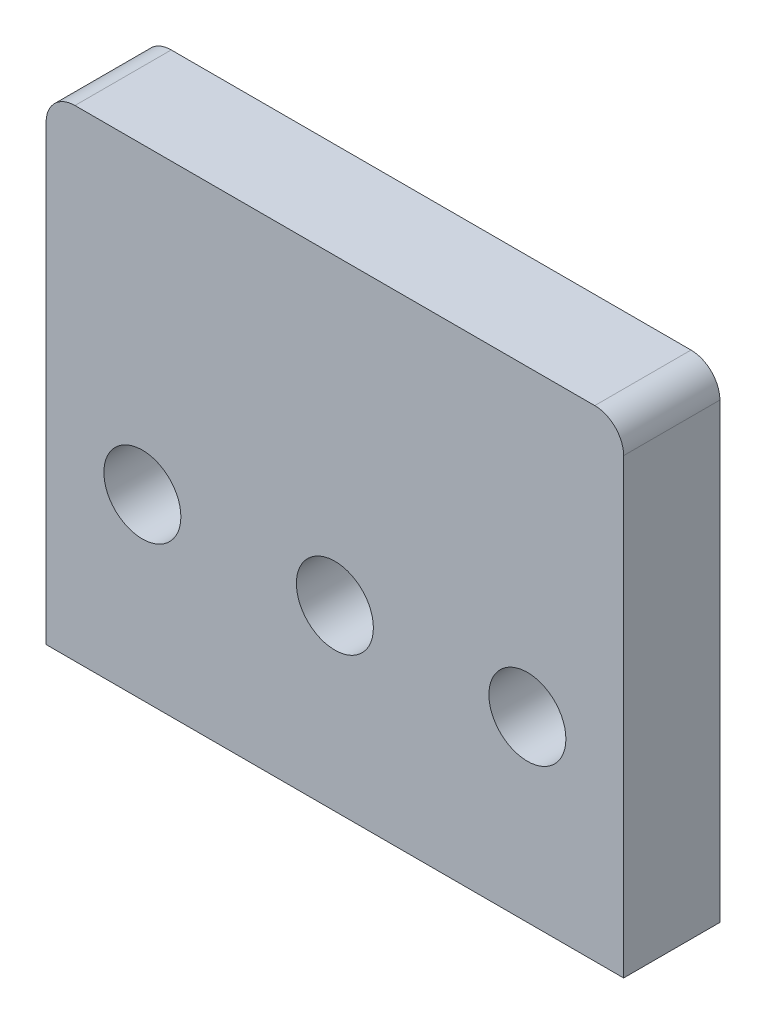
ISO-10303-21;
HEADER;
FILE_DESCRIPTION(('STEP AP214'),'2;1');
FILE_NAME('part.step','',(''),(''),'','','');
FILE_SCHEMA(('AUTOMOTIVE_DESIGN { 1 0 10303 214 1 1 1 1 }'));
ENDSEC;
DATA;
#1=APPLICATION_CONTEXT('core data for automotive mechanical design processes');
#2=APPLICATION_PROTOCOL_DEFINITION('international standard','automotive_design',2000,#1);
#3=PRODUCT_CONTEXT('',#1,'mechanical');
#4=PRODUCT('Part','Part','',(#3));
#5=PRODUCT_RELATED_PRODUCT_CATEGORY('part','',(#4));
#6=PRODUCT_DEFINITION_FORMATION('','',#4);
#7=PRODUCT_DEFINITION_CONTEXT('part definition',#1,'design');
#8=PRODUCT_DEFINITION('design','',#6,#7);
#9=PRODUCT_DEFINITION_SHAPE('','',#8);
#10=(LENGTH_UNIT() NAMED_UNIT(*) SI_UNIT(.MILLI.,.METRE.));
#11=(NAMED_UNIT(*) PLANE_ANGLE_UNIT() SI_UNIT($,.RADIAN.));
#12=(NAMED_UNIT(*) SI_UNIT($,.STERADIAN.) SOLID_ANGLE_UNIT());
#13=UNCERTAINTY_MEASURE_WITH_UNIT(LENGTH_MEASURE(1.E-05),#10,'distance_accuracy_value','');
#14=(GEOMETRIC_REPRESENTATION_CONTEXT(3) GLOBAL_UNCERTAINTY_ASSIGNED_CONTEXT((#13)) GLOBAL_UNIT_ASSIGNED_CONTEXT((#10,
#11,#12)) REPRESENTATION_CONTEXT('',''));
#15=CARTESIAN_POINT('',(0.,0.,0.));
#16=DIRECTION('',(0.,0.,1.));
#17=DIRECTION('',(1.,0.,0.));
#18=AXIS2_PLACEMENT_3D('',#15,#16,#17);
#19=CARTESIAN_POINT('',(-30.,-18.5,10.));
#20=DIRECTION('',(-1.,0.,0.));
#21=DIRECTION('',(0.,0.,1.));
#22=AXIS2_PLACEMENT_3D('',#19,#20,#21);
#23=PLANE('',#22);
#24=DIRECTION('',(0.,1.,0.));
#25=VECTOR('',#24,1.);
#26=CARTESIAN_POINT('',(-30.,-18.5,10.));
#27=LINE('',#26,#25);
#28=CARTESIAN_POINT('',(-30.,-18.5,10.));
#29=VERTEX_POINT('',#28);
#30=CARTESIAN_POINT('',(-30.,28.5,10.));
#31=VERTEX_POINT('',#30);
#32=EDGE_CURVE('E103',#29,#31,#27,.T.);
#33=ORIENTED_EDGE('',*,*,#32,.T.);
#34=DIRECTION('',(0.,0.,-1.));
#35=VECTOR('',#34,1.);
#36=CARTESIAN_POINT('',(-30.,28.5,10.));
#37=LINE('',#36,#35);
#38=CARTESIAN_POINT('',(-30.,28.5,0.));
#39=VERTEX_POINT('',#38);
#40=EDGE_CURVE('E114',#31,#39,#37,.T.);
#41=ORIENTED_EDGE('',*,*,#40,.T.);
#42=DIRECTION('',(0.,1.,0.));
#43=VECTOR('',#42,1.);
#44=CARTESIAN_POINT('',(-30.,-18.5,0.));
#45=LINE('',#44,#43);
#46=CARTESIAN_POINT('',(-30.,-18.5,0.));
#47=VERTEX_POINT('',#46);
#48=EDGE_CURVE('E133',#47,#39,#45,.T.);
#49=ORIENTED_EDGE('',*,*,#48,.F.);
#50=DIRECTION('',(0.,0.,-1.));
#51=VECTOR('',#50,1.);
#52=CARTESIAN_POINT('',(-30.,-18.5,10.));
#53=LINE('',#52,#51);
#54=EDGE_CURVE('E99',#29,#47,#53,.T.);
#55=ORIENTED_EDGE('',*,*,#54,.F.);
#56=EDGE_LOOP('',(#33,#41,#49,#55));
#57=FACE_BOUND('',#56,.T.);
#58=ADVANCED_FACE('F29',(#57),#23,.T.);
#59=CARTESIAN_POINT('',(-30.,-18.5,10.));
#60=DIRECTION('',(0.,1.,0.));
#61=DIRECTION('',(0.,0.,1.));
#62=AXIS2_PLACEMENT_3D('',#59,#60,#61);
#63=PLANE('',#62);
#64=DIRECTION('',(0.,0.,-1.));
#65=VECTOR('',#64,1.);
#66=CARTESIAN_POINT('',(30.,-18.5,10.));
#67=LINE('',#66,#65);
#68=CARTESIAN_POINT('',(30.,-18.5,10.));
#69=VERTEX_POINT('',#68);
#70=CARTESIAN_POINT('',(30.,-18.5,0.));
#71=VERTEX_POINT('',#70);
#72=EDGE_CURVE('E93',#69,#71,#67,.T.);
#73=ORIENTED_EDGE('',*,*,#72,.F.);
#74=DIRECTION('',(1.,0.,0.));
#75=VECTOR('',#74,1.);
#76=CARTESIAN_POINT('',(-30.,-18.5,10.));
#77=LINE('',#76,#75);
#78=EDGE_CURVE('E100',#29,#69,#77,.T.);
#79=ORIENTED_EDGE('',*,*,#78,.F.);
#80=ORIENTED_EDGE('',*,*,#54,.T.);
#81=DIRECTION('',(1.,0.,0.));
#82=VECTOR('',#81,1.);
#83=CARTESIAN_POINT('',(-30.,-18.5,0.));
#84=LINE('',#83,#82);
#85=EDGE_CURVE('E87',#47,#71,#84,.T.);
#86=ORIENTED_EDGE('',*,*,#85,.T.);
#87=EDGE_LOOP('',(#73,#79,#80,#86));
#88=FACE_BOUND('',#87,.T.);
#89=ADVANCED_FACE('F31',(#88),#63,.F.);
#90=CARTESIAN_POINT('',(30.,31.5,10.));
#91=DIRECTION('',(1.,0.,0.));
#92=DIRECTION('',(0.,0.,-1.));
#93=AXIS2_PLACEMENT_3D('',#90,#91,#92);
#94=PLANE('',#93);
#95=DIRECTION('',(0.,-1.,0.));
#96=VECTOR('',#95,1.);
#97=CARTESIAN_POINT('',(30.,31.5,0.));
#98=LINE('',#97,#96);
#99=CARTESIAN_POINT('',(30.,28.5,0.));
#100=VERTEX_POINT('',#99);
#101=EDGE_CURVE('E82',#100,#71,#98,.T.);
#102=ORIENTED_EDGE('',*,*,#101,.F.);
#103=DIRECTION('',(0.,0.,-1.));
#104=VECTOR('',#103,1.);
#105=CARTESIAN_POINT('',(30.,28.5,10.));
#106=LINE('',#105,#104);
#107=CARTESIAN_POINT('',(30.,28.5,10.));
#108=VERTEX_POINT('',#107);
#109=EDGE_CURVE('E11',#100,#108,#106,.F.);
#110=ORIENTED_EDGE('',*,*,#109,.T.);
#111=DIRECTION('',(0.,-1.,0.));
#112=VECTOR('',#111,1.);
#113=CARTESIAN_POINT('',(30.,31.5,10.));
#114=LINE('',#113,#112);
#115=EDGE_CURVE('E95',#108,#69,#114,.T.);
#116=ORIENTED_EDGE('',*,*,#115,.T.);
#117=ORIENTED_EDGE('',*,*,#72,.T.);
#118=EDGE_LOOP('',(#102,#110,#116,#117));
#119=FACE_BOUND('',#118,.T.);
#120=ADVANCED_FACE('F94',(#119),#94,.T.);
#121=CARTESIAN_POINT('',(30.,31.5,10.));
#122=DIRECTION('',(0.,-1.,0.));
#123=DIRECTION('',(1.,0.,0.));
#124=AXIS2_PLACEMENT_3D('',#121,#122,#123);
#125=PLANE('',#124);
#126=DIRECTION('',(-1.,0.,0.));
#127=VECTOR('',#126,1.);
#128=CARTESIAN_POINT('',(30.,31.5,0.));
#129=LINE('',#128,#127);
#130=CARTESIAN_POINT('',(27.,31.5,0.));
#131=VERTEX_POINT('',#130);
#132=CARTESIAN_POINT('',(-27.,31.5,0.));
#133=VERTEX_POINT('',#132);
#134=EDGE_CURVE('E90',#131,#133,#129,.T.);
#135=ORIENTED_EDGE('',*,*,#134,.T.);
#136=DIRECTION('',(0.,0.,-1.));
#137=VECTOR('',#136,1.);
#138=CARTESIAN_POINT('',(-27.,31.5,10.));
#139=LINE('',#138,#137);
#140=CARTESIAN_POINT('',(-27.,31.5,10.));
#141=VERTEX_POINT('',#140);
#142=EDGE_CURVE('E50',#133,#141,#139,.F.);
#143=ORIENTED_EDGE('',*,*,#142,.T.);
#144=DIRECTION('',(-1.,0.,0.));
#145=VECTOR('',#144,1.);
#146=CARTESIAN_POINT('',(30.,31.5,10.));
#147=LINE('',#146,#145);
#148=CARTESIAN_POINT('',(27.,31.5,10.));
#149=VERTEX_POINT('',#148);
#150=EDGE_CURVE('E106',#149,#141,#147,.T.);
#151=ORIENTED_EDGE('',*,*,#150,.F.);
#152=DIRECTION('',(0.,0.,-1.));
#153=VECTOR('',#152,1.);
#154=CARTESIAN_POINT('',(27.,31.5,10.));
#155=LINE('',#154,#153);
#156=EDGE_CURVE('E120',#149,#131,#155,.T.);
#157=ORIENTED_EDGE('',*,*,#156,.T.);
#158=EDGE_LOOP('',(#135,#143,#151,#157));
#159=FACE_BOUND('',#158,.T.);
#160=ADVANCED_FACE('F134',(#159),#125,.F.);
#161=CARTESIAN_POINT('',(-30.,-18.5,10.));
#162=DIRECTION('',(0.,0.,-1.));
#163=DIRECTION('',(-1.,0.,0.));
#164=AXIS2_PLACEMENT_3D('',#161,#162,#163);
#165=PLANE('',#164);
#166=CARTESIAN_POINT('',(20.,0.,10.));
#167=DIRECTION('',(0.,0.,1.));
#168=DIRECTION('',(1.,0.,0.));
#169=AXIS2_PLACEMENT_3D('',#166,#167,#168);
#170=CIRCLE('',#169,4.);
#171=CARTESIAN_POINT('',(24.,0.,10.));
#172=VERTEX_POINT('',#171);
#173=EDGE_CURVE('E153',#172,#172,#170,.T.);
#174=ORIENTED_EDGE('',*,*,#173,.F.);
#175=EDGE_LOOP('',(#174));
#176=FACE_BOUND('',#175,.T.);
#177=CARTESIAN_POINT('',(0.,0.,10.));
#178=DIRECTION('',(0.,0.,1.));
#179=DIRECTION('',(1.,0.,0.));
#180=AXIS2_PLACEMENT_3D('',#177,#178,#179);
#181=CIRCLE('',#180,4.);
#182=CARTESIAN_POINT('',(4.,0.,10.));
#183=VERTEX_POINT('',#182);
#184=EDGE_CURVE('E147',#183,#183,#181,.T.);
#185=ORIENTED_EDGE('',*,*,#184,.F.);
#186=EDGE_LOOP('',(#185));
#187=FACE_BOUND('',#186,.T.);
#188=CARTESIAN_POINT('',(-20.,0.,10.));
#189=DIRECTION('',(0.,0.,1.));
#190=DIRECTION('',(1.,0.,0.));
#191=AXIS2_PLACEMENT_3D('',#188,#189,#190);
#192=CIRCLE('',#191,4.);
#193=CARTESIAN_POINT('',(-16.,0.,10.));
#194=VERTEX_POINT('',#193);
#195=EDGE_CURVE('E141',#194,#194,#192,.T.);
#196=ORIENTED_EDGE('',*,*,#195,.F.);
#197=EDGE_LOOP('',(#196));
#198=FACE_BOUND('',#197,.T.);
#199=ORIENTED_EDGE('',*,*,#150,.T.);
#200=CARTESIAN_POINT('',(-27.,28.5,10.));
#201=DIRECTION('',(0.,0.,-1.));
#202=DIRECTION('',(-1.,0.,0.));
#203=AXIS2_PLACEMENT_3D('',#200,#201,#202);
#204=CIRCLE('',#203,3.);
#205=EDGE_CURVE('E37',#141,#31,#204,.F.);
#206=ORIENTED_EDGE('',*,*,#205,.T.);
#207=ORIENTED_EDGE('',*,*,#32,.F.);
#208=ORIENTED_EDGE('',*,*,#78,.T.);
#209=ORIENTED_EDGE('',*,*,#115,.F.);
#210=CARTESIAN_POINT('',(27.,28.5,10.));
#211=DIRECTION('',(0.,0.,-1.));
#212=DIRECTION('',(-1.,0.,0.));
#213=AXIS2_PLACEMENT_3D('',#210,#211,#212);
#214=CIRCLE('',#213,3.);
#215=EDGE_CURVE('E124',#108,#149,#214,.F.);
#216=ORIENTED_EDGE('',*,*,#215,.T.);
#217=EDGE_LOOP('',(#199,#206,#207,#208,#209,#216));
#218=FACE_BOUND('',#217,.T.);
#219=ADVANCED_FACE('F128',(#176,#187,#198,#218),#165,.F.);
#220=CARTESIAN_POINT('',(-30.,-18.5,0.));
#221=DIRECTION('',(0.,0.,-1.));
#222=DIRECTION('',(-1.,0.,0.));
#223=AXIS2_PLACEMENT_3D('',#220,#221,#222);
#224=PLANE('',#223);
#225=CARTESIAN_POINT('',(20.,0.,0.));
#226=DIRECTION('',(0.,0.,1.));
#227=DIRECTION('',(1.,0.,0.));
#228=AXIS2_PLACEMENT_3D('',#225,#226,#227);
#229=CIRCLE('',#228,4.);
#230=CARTESIAN_POINT('',(24.,0.,0.));
#231=VERTEX_POINT('',#230);
#232=EDGE_CURVE('E150',#231,#231,#229,.T.);
#233=ORIENTED_EDGE('',*,*,#232,.T.);
#234=EDGE_LOOP('',(#233));
#235=FACE_BOUND('',#234,.T.);
#236=CARTESIAN_POINT('',(0.,0.,0.));
#237=DIRECTION('',(0.,0.,1.));
#238=DIRECTION('',(1.,0.,0.));
#239=AXIS2_PLACEMENT_3D('',#236,#237,#238);
#240=CIRCLE('',#239,4.);
#241=CARTESIAN_POINT('',(4.,0.,0.));
#242=VERTEX_POINT('',#241);
#243=EDGE_CURVE('E144',#242,#242,#240,.T.);
#244=ORIENTED_EDGE('',*,*,#243,.T.);
#245=EDGE_LOOP('',(#244));
#246=FACE_BOUND('',#245,.T.);
#247=CARTESIAN_POINT('',(-20.,0.,0.));
#248=DIRECTION('',(0.,0.,1.));
#249=DIRECTION('',(1.,0.,0.));
#250=AXIS2_PLACEMENT_3D('',#247,#248,#249);
#251=CIRCLE('',#250,4.);
#252=CARTESIAN_POINT('',(-16.,0.,0.));
#253=VERTEX_POINT('',#252);
#254=EDGE_CURVE('E136',#253,#253,#251,.T.);
#255=ORIENTED_EDGE('',*,*,#254,.T.);
#256=EDGE_LOOP('',(#255));
#257=FACE_BOUND('',#256,.T.);
#258=ORIENTED_EDGE('',*,*,#48,.T.);
#259=CARTESIAN_POINT('',(-27.,28.5,0.));
#260=DIRECTION('',(0.,0.,-1.));
#261=DIRECTION('',(-1.,0.,0.));
#262=AXIS2_PLACEMENT_3D('',#259,#260,#261);
#263=CIRCLE('',#262,3.);
#264=EDGE_CURVE('E118',#39,#133,#263,.T.);
#265=ORIENTED_EDGE('',*,*,#264,.T.);
#266=ORIENTED_EDGE('',*,*,#134,.F.);
#267=CARTESIAN_POINT('',(27.,28.5,0.));
#268=DIRECTION('',(0.,0.,-1.));
#269=DIRECTION('',(-1.,0.,0.));
#270=AXIS2_PLACEMENT_3D('',#267,#268,#269);
#271=CIRCLE('',#270,3.);
#272=EDGE_CURVE('E89',#131,#100,#271,.T.);
#273=ORIENTED_EDGE('',*,*,#272,.T.);
#274=ORIENTED_EDGE('',*,*,#101,.T.);
#275=ORIENTED_EDGE('',*,*,#85,.F.);
#276=EDGE_LOOP('',(#258,#265,#266,#273,#274,#275));
#277=FACE_BOUND('',#276,.T.);
#278=ADVANCED_FACE('F85',(#235,#246,#257,#277),#224,.T.);
#279=CARTESIAN_POINT('',(-27.,28.5,10.));
#280=DIRECTION('',(0.,0.,1.));
#281=DIRECTION('',(1.,0.,0.));
#282=AXIS2_PLACEMENT_3D('',#279,#280,#281);
#283=CYLINDRICAL_SURFACE('',#282,3.);
#284=ORIENTED_EDGE('',*,*,#205,.F.);
#285=ORIENTED_EDGE('',*,*,#142,.F.);
#286=ORIENTED_EDGE('',*,*,#264,.F.);
#287=ORIENTED_EDGE('',*,*,#40,.F.);
#288=EDGE_LOOP('',(#284,#285,#286,#287));
#289=FACE_BOUND('',#288,.T.);
#290=ADVANCED_FACE('F132',(#289),#283,.T.);
#291=CARTESIAN_POINT('',(27.,28.5,10.));
#292=DIRECTION('',(0.,0.,1.));
#293=DIRECTION('',(1.,0.,0.));
#294=AXIS2_PLACEMENT_3D('',#291,#292,#293);
#295=CYLINDRICAL_SURFACE('',#294,3.);
#296=ORIENTED_EDGE('',*,*,#215,.F.);
#297=ORIENTED_EDGE('',*,*,#109,.F.);
#298=ORIENTED_EDGE('',*,*,#272,.F.);
#299=ORIENTED_EDGE('',*,*,#156,.F.);
#300=EDGE_LOOP('',(#296,#297,#298,#299));
#301=FACE_BOUND('',#300,.T.);
#302=ADVANCED_FACE('F169',(#301),#295,.T.);
#303=CARTESIAN_POINT('',(-20.,0.,0.));
#304=DIRECTION('',(0.,0.,1.));
#305=DIRECTION('',(1.,0.,0.));
#306=AXIS2_PLACEMENT_3D('',#303,#304,#305);
#307=CYLINDRICAL_SURFACE('',#306,4.);
#308=ORIENTED_EDGE('',*,*,#254,.F.);
#309=EDGE_LOOP('',(#308));
#310=FACE_BOUND('',#309,.T.);
#311=ORIENTED_EDGE('',*,*,#195,.T.);
#312=EDGE_LOOP('',(#311));
#313=FACE_BOUND('',#312,.T.);
#314=ADVANCED_FACE('F166',(#310,#313),#307,.F.);
#315=CARTESIAN_POINT('',(0.,0.,0.));
#316=DIRECTION('',(0.,0.,1.));
#317=DIRECTION('',(1.,0.,0.));
#318=AXIS2_PLACEMENT_3D('',#315,#316,#317);
#319=CYLINDRICAL_SURFACE('',#318,4.);
#320=ORIENTED_EDGE('',*,*,#243,.F.);
#321=EDGE_LOOP('',(#320));
#322=FACE_BOUND('',#321,.T.);
#323=ORIENTED_EDGE('',*,*,#184,.T.);
#324=EDGE_LOOP('',(#323));
#325=FACE_BOUND('',#324,.T.);
#326=ADVANCED_FACE('F168',(#322,#325),#319,.F.);
#327=CARTESIAN_POINT('',(20.,0.,0.));
#328=DIRECTION('',(0.,0.,1.));
#329=DIRECTION('',(1.,0.,0.));
#330=AXIS2_PLACEMENT_3D('',#327,#328,#329);
#331=CYLINDRICAL_SURFACE('',#330,4.);
#332=ORIENTED_EDGE('',*,*,#232,.F.);
#333=EDGE_LOOP('',(#332));
#334=FACE_BOUND('',#333,.T.);
#335=ORIENTED_EDGE('',*,*,#173,.T.);
#336=EDGE_LOOP('',(#335));
#337=FACE_BOUND('',#336,.T.);
#338=ADVANCED_FACE('F157',(#334,#337),#331,.F.);
#339=CLOSED_SHELL('',(#58,#89,#120,#160,#219,#278,#290,#302,#314,#326,#338));
#340=MANIFOLD_SOLID_BREP('B2',#339);
#341=ADVANCED_BREP_SHAPE_REPRESENTATION('',(#18,#340),#14);
#342=SHAPE_DEFINITION_REPRESENTATION(#9,#341);
ENDSEC;
END-ISO-10303-21;
